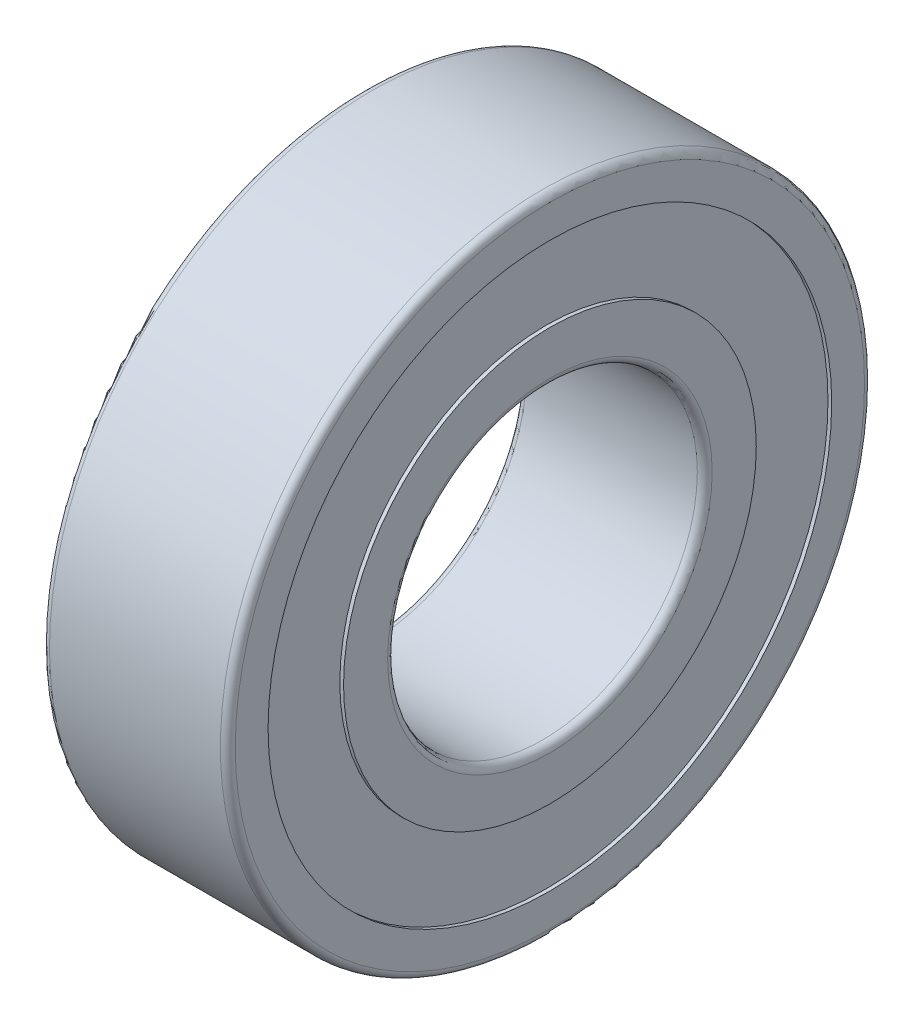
from build123d import *

# Parameters (mm, degrees)
CROQUIS2_R            = 22.75
CROQUIS2_R_2          = 16.66
CORTAR_EXTRUIR1_DEPTH = 0.3
REDONDEO1_R           = 0.6


with BuildPart() as part:
    # Croquis1 → Revoluci_n1 (revolve)
    with BuildSketch(Plane(origin=(0, 0, 0), x_dir=(1, 0, 0), z_dir=(0, 1, 0))):
        Polygon((0, 26), (7.5, 26), (7.5, 12.5), (0, 12.5), (-7.5, 12.5), (-7.5, 26), align=None)
    revolve(axis=Axis((0, 0, 0), (-1, 0, 0)))

    # Croquis2 → Cortar-Extruir1 (cut)
    with BuildSketch(Plane(origin=(7.5, 0, 0), x_dir=(0, 0, -1), z_dir=(1, 0, 0))):
        Circle(CROQUIS2_R)
        Circle(CROQUIS2_R_2, mode=Mode.SUBTRACT)
    cortar_extruir1 = extrude(amount=-CORTAR_EXTRUIR1_DEPTH, mode=Mode.SUBTRACT)

    # Simetr_a1: Cortar-Extruir1 across plane
    add(cortar_extruir1.mirror(Plane(origin=(0, 0, 0), x_dir=(0, 0, 1), z_dir=(1, 0, 0))), mode=Mode.SUBTRACT)

    # Redondeo1
    redondeo1_edges = [part.edges().sort_by_distance(p)[0] for p in [
        (-7.5, 0, 26),
        (-7.5, 0, 12.5),
        (7.5, 0, 12.5),
        (7.5, 0, 26),
    ]]
    fillet(redondeo1_edges, radius=REDONDEO1_R)


solid = part.part
